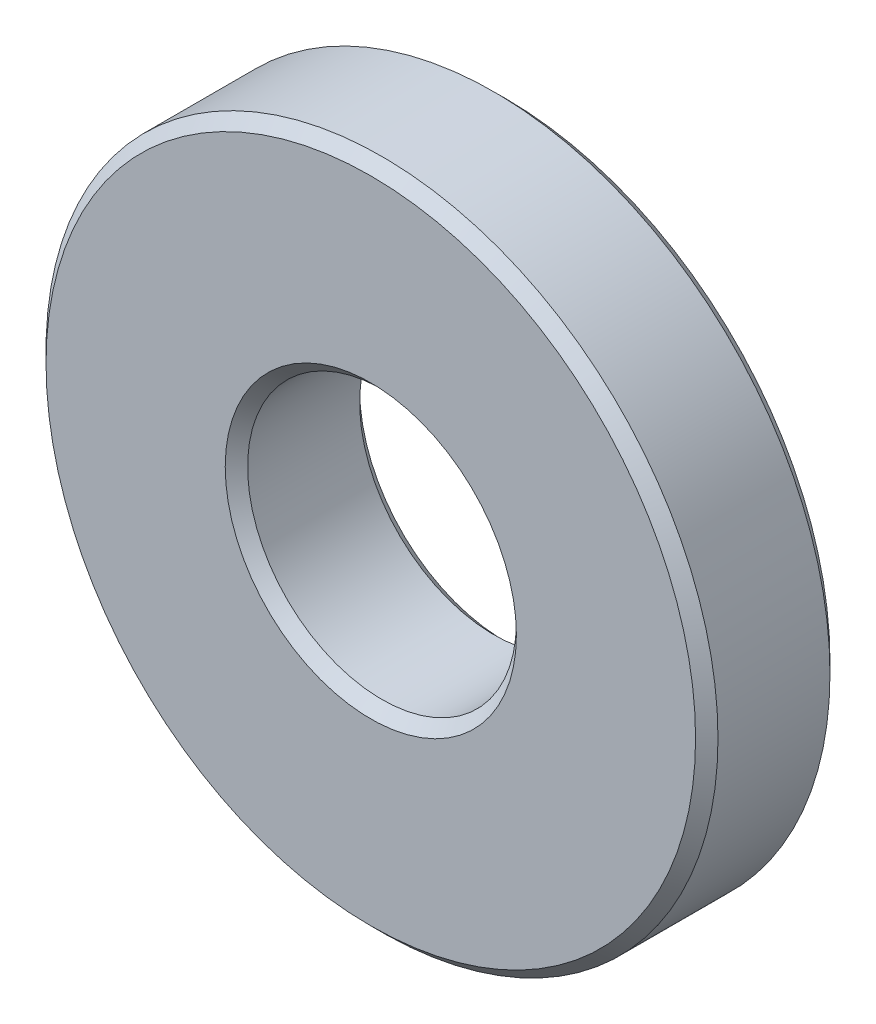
ISO-10303-21;
HEADER;
FILE_DESCRIPTION(('STEP AP214'),'2;1');
FILE_NAME('part.step','',(''),(''),'','','');
FILE_SCHEMA(('AUTOMOTIVE_DESIGN { 1 0 10303 214 1 1 1 1 }'));
ENDSEC;
DATA;
#1=APPLICATION_CONTEXT('core data for automotive mechanical design processes');
#2=APPLICATION_PROTOCOL_DEFINITION('international standard','automotive_design',2000,#1);
#3=PRODUCT_CONTEXT('',#1,'mechanical');
#4=PRODUCT('Part','Part','',(#3));
#5=PRODUCT_RELATED_PRODUCT_CATEGORY('part','',(#4));
#6=PRODUCT_DEFINITION_FORMATION('','',#4);
#7=PRODUCT_DEFINITION_CONTEXT('part definition',#1,'design');
#8=PRODUCT_DEFINITION('design','',#6,#7);
#9=PRODUCT_DEFINITION_SHAPE('','',#8);
#10=(LENGTH_UNIT() NAMED_UNIT(*) SI_UNIT(.MILLI.,.METRE.));
#11=(NAMED_UNIT(*) PLANE_ANGLE_UNIT() SI_UNIT($,.RADIAN.));
#12=(NAMED_UNIT(*) SI_UNIT($,.STERADIAN.) SOLID_ANGLE_UNIT());
#13=UNCERTAINTY_MEASURE_WITH_UNIT(LENGTH_MEASURE(1.E-05),#10,'distance_accuracy_value','');
#14=(GEOMETRIC_REPRESENTATION_CONTEXT(3) GLOBAL_UNCERTAINTY_ASSIGNED_CONTEXT((#13)) GLOBAL_UNIT_ASSIGNED_CONTEXT((#10,
#11,#12)) REPRESENTATION_CONTEXT('',''));
#15=CARTESIAN_POINT('',(0.,0.,0.));
#16=DIRECTION('',(0.,0.,1.));
#17=DIRECTION('',(1.,0.,0.));
#18=AXIS2_PLACEMENT_3D('',#15,#16,#17);
#19=CARTESIAN_POINT('',(0.,0.,3.));
#20=DIRECTION('',(0.,0.,1.));
#21=DIRECTION('',(1.,0.,0.));
#22=AXIS2_PLACEMENT_3D('',#19,#20,#21);
#23=PLANE('',#22);
#24=CARTESIAN_POINT('',(0.,0.,3.));
#25=DIRECTION('',(0.,0.,1.));
#26=DIRECTION('',(1.,0.,0.));
#27=AXIS2_PLACEMENT_3D('',#24,#25,#26);
#28=CIRCLE('',#27,7.25);
#29=CARTESIAN_POINT('',(7.25,0.,3.));
#30=VERTEX_POINT('',#29);
#31=EDGE_CURVE('E40',#30,#30,#28,.T.);
#32=ORIENTED_EDGE('',*,*,#31,.T.);
#33=EDGE_LOOP('',(#32));
#34=FACE_BOUND('',#33,.T.);
#35=CARTESIAN_POINT('',(0.,0.,3.));
#36=DIRECTION('',(0.,0.,1.));
#37=DIRECTION('',(1.,0.,0.));
#38=AXIS2_PLACEMENT_3D('',#35,#36,#37);
#39=CIRCLE('',#38,3.25);
#40=CARTESIAN_POINT('',(3.25,0.,3.));
#41=VERTEX_POINT('',#40);
#42=EDGE_CURVE('E44',#41,#41,#39,.F.);
#43=ORIENTED_EDGE('',*,*,#42,.T.);
#44=EDGE_LOOP('',(#43));
#45=FACE_BOUND('',#44,.T.);
#46=ADVANCED_FACE('F29',(#34,#45),#23,.T.);
#47=CARTESIAN_POINT('',(0.,0.,0.));
#48=DIRECTION('',(0.,0.,1.));
#49=DIRECTION('',(1.,0.,0.));
#50=AXIS2_PLACEMENT_3D('',#47,#48,#49);
#51=PLANE('',#50);
#52=CARTESIAN_POINT('',(0.,0.,0.));
#53=DIRECTION('',(0.,0.,1.));
#54=DIRECTION('',(1.,0.,0.));
#55=AXIS2_PLACEMENT_3D('',#52,#53,#54);
#56=CIRCLE('',#55,7.25);
#57=CARTESIAN_POINT('',(7.25,0.,0.));
#58=VERTEX_POINT('',#57);
#59=EDGE_CURVE('E49',#58,#58,#56,.F.);
#60=ORIENTED_EDGE('',*,*,#59,.T.);
#61=EDGE_LOOP('',(#60));
#62=FACE_BOUND('',#61,.T.);
#63=CARTESIAN_POINT('',(0.,0.,0.));
#64=DIRECTION('',(0.,0.,1.));
#65=DIRECTION('',(1.,0.,0.));
#66=AXIS2_PLACEMENT_3D('',#63,#64,#65);
#67=CIRCLE('',#66,3.25);
#68=CARTESIAN_POINT('',(3.25,0.,0.));
#69=VERTEX_POINT('',#68);
#70=EDGE_CURVE('E52',#69,#69,#67,.T.);
#71=ORIENTED_EDGE('',*,*,#70,.T.);
#72=EDGE_LOOP('',(#71));
#73=FACE_BOUND('',#72,.T.);
#74=ADVANCED_FACE('F74',(#62,#73),#51,.F.);
#75=CARTESIAN_POINT('',(0.,0.,3.));
#76=DIRECTION('',(0.,0.,-1.));
#77=DIRECTION('',(-1.,0.,0.));
#78=AXIS2_PLACEMENT_3D('',#75,#76,#77);
#79=CYLINDRICAL_SURFACE('',#78,7.5);
#80=CARTESIAN_POINT('',(0.,0.,0.250000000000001));
#81=DIRECTION('',(0.,0.,1.));
#82=DIRECTION('',(1.,0.,0.));
#83=AXIS2_PLACEMENT_3D('',#80,#81,#82);
#84=CIRCLE('',#83,7.5);
#85=CARTESIAN_POINT('',(7.5,0.,0.250000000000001));
#86=VERTEX_POINT('',#85);
#87=EDGE_CURVE('E55',#86,#86,#84,.T.);
#88=ORIENTED_EDGE('',*,*,#87,.T.);
#89=EDGE_LOOP('',(#88));
#90=FACE_BOUND('',#89,.T.);
#91=CARTESIAN_POINT('',(0.,0.,2.75000000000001));
#92=DIRECTION('',(0.,0.,1.));
#93=DIRECTION('',(1.,0.,0.));
#94=AXIS2_PLACEMENT_3D('',#91,#92,#93);
#95=CIRCLE('',#94,7.5);
#96=CARTESIAN_POINT('',(7.5,0.,2.75000000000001));
#97=VERTEX_POINT('',#96);
#98=EDGE_CURVE('E58',#97,#97,#95,.F.);
#99=ORIENTED_EDGE('',*,*,#98,.T.);
#100=EDGE_LOOP('',(#99));
#101=FACE_BOUND('',#100,.T.);
#102=ADVANCED_FACE('F62',(#90,#101),#79,.T.);
#103=CARTESIAN_POINT('',(0.,0.,3.));
#104=DIRECTION('',(0.,0.,-1.));
#105=DIRECTION('',(-1.,0.,0.));
#106=AXIS2_PLACEMENT_3D('',#103,#104,#105);
#107=CYLINDRICAL_SURFACE('',#106,3.);
#108=CARTESIAN_POINT('',(0.,0.,0.250000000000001));
#109=DIRECTION('',(0.,0.,1.));
#110=DIRECTION('',(1.,0.,0.));
#111=AXIS2_PLACEMENT_3D('',#108,#109,#110);
#112=CIRCLE('',#111,3.);
#113=CARTESIAN_POINT('',(3.,0.,0.250000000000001));
#114=VERTEX_POINT('',#113);
#115=EDGE_CURVE('E10',#114,#114,#112,.F.);
#116=ORIENTED_EDGE('',*,*,#115,.T.);
#117=EDGE_LOOP('',(#116));
#118=FACE_BOUND('',#117,.T.);
#119=CARTESIAN_POINT('',(0.,0.,2.75));
#120=DIRECTION('',(0.,0.,1.));
#121=DIRECTION('',(1.,0.,0.));
#122=AXIS2_PLACEMENT_3D('',#119,#120,#121);
#123=CIRCLE('',#122,3.);
#124=CARTESIAN_POINT('',(3.,0.,2.75));
#125=VERTEX_POINT('',#124);
#126=EDGE_CURVE('E36',#125,#125,#123,.T.);
#127=ORIENTED_EDGE('',*,*,#126,.T.);
#128=EDGE_LOOP('',(#127));
#129=FACE_BOUND('',#128,.T.);
#130=ADVANCED_FACE('F90',(#118,#129),#107,.F.);
#131=CARTESIAN_POINT('',(0.,0.,0.250000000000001));
#132=DIRECTION('',(0.,0.,1.));
#133=DIRECTION('',(1.,0.,0.));
#134=AXIS2_PLACEMENT_3D('',#131,#132,#133);
#135=CONICAL_SURFACE('',#134,7.5,0.785398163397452);
#136=ORIENTED_EDGE('',*,*,#59,.F.);
#137=EDGE_LOOP('',(#136));
#138=FACE_BOUND('',#137,.T.);
#139=ORIENTED_EDGE('',*,*,#87,.F.);
#140=EDGE_LOOP('',(#139));
#141=FACE_BOUND('',#140,.T.);
#142=ADVANCED_FACE('F68',(#138,#141),#135,.T.);
#143=CARTESIAN_POINT('',(0.,0.,3.));
#144=DIRECTION('',(0.,0.,-1.));
#145=DIRECTION('',(-1.,0.,0.));
#146=AXIS2_PLACEMENT_3D('',#143,#144,#145);
#147=CONICAL_SURFACE('',#146,7.25,0.785398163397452);
#148=ORIENTED_EDGE('',*,*,#98,.F.);
#149=EDGE_LOOP('',(#148));
#150=FACE_BOUND('',#149,.T.);
#151=ORIENTED_EDGE('',*,*,#31,.F.);
#152=EDGE_LOOP('',(#151));
#153=FACE_BOUND('',#152,.T.);
#154=ADVANCED_FACE('F64',(#150,#153),#147,.T.);
#155=CARTESIAN_POINT('',(0.,0.,0.));
#156=DIRECTION('',(0.,0.,-1.));
#157=DIRECTION('',(-1.,0.,0.));
#158=AXIS2_PLACEMENT_3D('',#155,#156,#157);
#159=CONICAL_SURFACE('',#158,3.25,0.785398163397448);
#160=ORIENTED_EDGE('',*,*,#115,.F.);
#161=EDGE_LOOP('',(#160));
#162=FACE_BOUND('',#161,.T.);
#163=ORIENTED_EDGE('',*,*,#70,.F.);
#164=EDGE_LOOP('',(#163));
#165=FACE_BOUND('',#164,.T.);
#166=ADVANCED_FACE('F67',(#162,#165),#159,.F.);
#167=CARTESIAN_POINT('',(0.,0.,2.75));
#168=DIRECTION('',(0.,0.,1.));
#169=DIRECTION('',(1.,0.,0.));
#170=AXIS2_PLACEMENT_3D('',#167,#168,#169);
#171=CONICAL_SURFACE('',#170,3.,0.785398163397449);
#172=ORIENTED_EDGE('',*,*,#42,.F.);
#173=EDGE_LOOP('',(#172));
#174=FACE_BOUND('',#173,.T.);
#175=ORIENTED_EDGE('',*,*,#126,.F.);
#176=EDGE_LOOP('',(#175));
#177=FACE_BOUND('',#176,.T.);
#178=ADVANCED_FACE('F31',(#174,#177),#171,.F.);
#179=CLOSED_SHELL('',(#46,#74,#102,#130,#142,#154,#166,#178));
#180=MANIFOLD_SOLID_BREP('B2',#179);
#181=ADVANCED_BREP_SHAPE_REPRESENTATION('',(#18,#180),#14);
#182=SHAPE_DEFINITION_REPRESENTATION(#9,#181);
ENDSEC;
END-ISO-10303-21;
